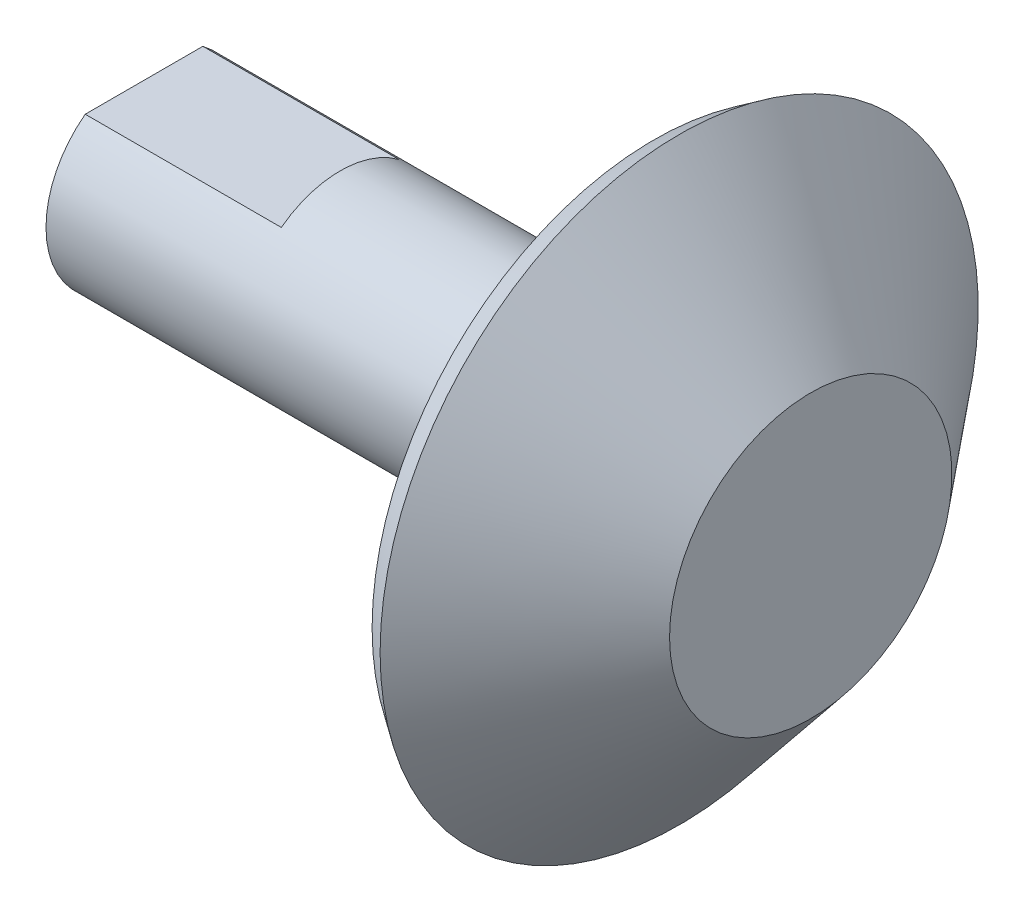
ISO-10303-21;
HEADER;
FILE_DESCRIPTION(('STEP AP214'),'2;1');
FILE_NAME('part.step','',(''),(''),'','','');
FILE_SCHEMA(('AUTOMOTIVE_DESIGN { 1 0 10303 214 1 1 1 1 }'));
ENDSEC;
DATA;
#1=APPLICATION_CONTEXT('core data for automotive mechanical design processes');
#2=APPLICATION_PROTOCOL_DEFINITION('international standard','automotive_design',2000,#1);
#3=PRODUCT_CONTEXT('',#1,'mechanical');
#4=PRODUCT('Part','Part','',(#3));
#5=PRODUCT_RELATED_PRODUCT_CATEGORY('part','',(#4));
#6=PRODUCT_DEFINITION_FORMATION('','',#4);
#7=PRODUCT_DEFINITION_CONTEXT('part definition',#1,'design');
#8=PRODUCT_DEFINITION('design','',#6,#7);
#9=PRODUCT_DEFINITION_SHAPE('','',#8);
#10=(LENGTH_UNIT() NAMED_UNIT(*) SI_UNIT(.MILLI.,.METRE.));
#11=(NAMED_UNIT(*) PLANE_ANGLE_UNIT() SI_UNIT($,.RADIAN.));
#12=(NAMED_UNIT(*) SI_UNIT($,.STERADIAN.) SOLID_ANGLE_UNIT());
#13=UNCERTAINTY_MEASURE_WITH_UNIT(LENGTH_MEASURE(1.E-05),#10,'distance_accuracy_value','');
#14=(GEOMETRIC_REPRESENTATION_CONTEXT(3) GLOBAL_UNCERTAINTY_ASSIGNED_CONTEXT((#13)) GLOBAL_UNIT_ASSIGNED_CONTEXT((#10,
#11,#12)) REPRESENTATION_CONTEXT('',''));
#15=CARTESIAN_POINT('',(0.,0.,0.));
#16=DIRECTION('',(0.,0.,1.));
#17=DIRECTION('',(1.,0.,0.));
#18=AXIS2_PLACEMENT_3D('',#15,#16,#17);
#19=CARTESIAN_POINT('',(-20.,0.,0.));
#20=DIRECTION('',(1.,0.,0.));
#21=DIRECTION('',(0.,0.,-1.));
#22=AXIS2_PLACEMENT_3D('',#19,#20,#21);
#23=PLANE('',#22);
#24=CARTESIAN_POINT('',(-20.,0.,0.));
#25=DIRECTION('',(-1.,0.,0.));
#26=DIRECTION('',(0.,0.,1.));
#27=AXIS2_PLACEMENT_3D('',#24,#25,#26);
#28=CIRCLE('',#27,2.50000000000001);
#29=CARTESIAN_POINT('',(-20.,2.,-1.50000000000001));
#30=VERTEX_POINT('',#29);
#31=CARTESIAN_POINT('',(-20.,2.,1.50000000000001));
#32=VERTEX_POINT('',#31);
#33=EDGE_CURVE('E382',#30,#32,#28,.T.);
#34=ORIENTED_EDGE('',*,*,#33,.T.);
#35=DIRECTION('',(0.,0.,1.));
#36=VECTOR('',#35,1.);
#37=CARTESIAN_POINT('',(-20.,2.,-3.29091748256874));
#38=LINE('',#37,#36);
#39=EDGE_CURVE('E377',#30,#32,#38,.T.);
#40=ORIENTED_EDGE('',*,*,#39,.F.);
#41=EDGE_LOOP('',(#34,#40));
#42=FACE_BOUND('',#41,.T.);
#43=ADVANCED_FACE('F350',(#42),#23,.F.);
#44=CARTESIAN_POINT('',(-8.66911579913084,0.,0.));
#45=DIRECTION('',(-1.,0.,0.));
#46=DIRECTION('',(0.,0.,1.));
#47=AXIS2_PLACEMENT_3D('',#44,#45,#46);
#48=CYLINDRICAL_SURFACE('',#47,2.50000000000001);
#49=CARTESIAN_POINT('',(-15.,0.,0.));
#50=DIRECTION('',(-1.,0.,0.));
#51=DIRECTION('',(0.,0.,1.));
#52=AXIS2_PLACEMENT_3D('',#49,#50,#51);
#53=CIRCLE('',#52,2.50000000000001);
#54=CARTESIAN_POINT('',(-15.,2.,1.50000000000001));
#55=VERTEX_POINT('',#54);
#56=CARTESIAN_POINT('',(-15.,2.,-1.50000000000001));
#57=VERTEX_POINT('',#56);
#58=EDGE_CURVE('E367',#55,#57,#53,.T.);
#59=ORIENTED_EDGE('',*,*,#58,.F.);
#60=DIRECTION('',(-1.,0.,0.));
#61=VECTOR('',#60,1.);
#62=CARTESIAN_POINT('',(-8.66911579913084,2.,1.50000000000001));
#63=LINE('',#62,#61);
#64=EDGE_CURVE('E11',#55,#32,#63,.T.);
#65=ORIENTED_EDGE('',*,*,#64,.T.);
#66=ORIENTED_EDGE('',*,*,#33,.F.);
#67=DIRECTION('',(-1.,0.,0.));
#68=VECTOR('',#67,1.);
#69=CARTESIAN_POINT('',(-8.66911579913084,2.,-1.50000000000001));
#70=LINE('',#69,#68);
#71=EDGE_CURVE('E357',#30,#57,#70,.F.);
#72=ORIENTED_EDGE('',*,*,#71,.T.);
#73=EDGE_LOOP('',(#59,#65,#66,#72));
#74=FACE_BOUND('',#73,.T.);
#75=CARTESIAN_POINT('',(-7.,0.,0.));
#76=DIRECTION('',(-1.,0.,0.));
#77=DIRECTION('',(0.,0.,1.));
#78=AXIS2_PLACEMENT_3D('',#75,#76,#77);
#79=CIRCLE('',#78,2.50000000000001);
#80=CARTESIAN_POINT('',(-7.,0.,2.50000000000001));
#81=VERTEX_POINT('',#80);
#82=EDGE_CURVE('E386',#81,#81,#79,.T.);
#83=ORIENTED_EDGE('',*,*,#82,.T.);
#84=EDGE_LOOP('',(#83));
#85=FACE_BOUND('',#84,.T.);
#86=ADVANCED_FACE('F384',(#74,#85),#48,.T.);
#87=CARTESIAN_POINT('',(-7.,2.50000000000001,0.));
#88=DIRECTION('',(1.,0.,0.));
#89=DIRECTION('',(0.,0.,-1.));
#90=AXIS2_PLACEMENT_3D('',#87,#88,#89);
#91=PLANE('',#90);
#92=ORIENTED_EDGE('',*,*,#82,.F.);
#93=EDGE_LOOP('',(#92));
#94=FACE_BOUND('',#93,.T.);
#95=CARTESIAN_POINT('',(-7.,0.,0.));
#96=DIRECTION('',(-1.,0.,0.));
#97=DIRECTION('',(0.,0.,1.));
#98=AXIS2_PLACEMENT_3D('',#95,#96,#97);
#99=CIRCLE('',#98,7.18468354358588);
#100=CARTESIAN_POINT('',(-7.,0.,7.18468354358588));
#101=VERTEX_POINT('',#100);
#102=EDGE_CURVE('E390',#101,#101,#99,.T.);
#103=ORIENTED_EDGE('',*,*,#102,.T.);
#104=EDGE_LOOP('',(#103));
#105=FACE_BOUND('',#104,.T.);
#106=ADVANCED_FACE('F421',(#94,#105),#91,.F.);
#107=CARTESIAN_POINT('',(-6.35498481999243,0.,0.));
#108=DIRECTION('',(1.,0.,0.));
#109=DIRECTION('',(0.,0.,-1.));
#110=AXIS2_PLACEMENT_3D('',#107,#108,#109);
#111=CONICAL_SURFACE('',#110,7.62598178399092,0.600020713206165);
#112=ORIENTED_EDGE('',*,*,#102,.F.);
#113=EDGE_LOOP('',(#112));
#114=FACE_BOUND('',#113,.T.);
#115=CARTESIAN_POINT('',(-6.35498481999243,0.,0.));
#116=DIRECTION('',(-1.,0.,0.));
#117=DIRECTION('',(0.,0.,1.));
#118=AXIS2_PLACEMENT_3D('',#115,#116,#117);
#119=CIRCLE('',#118,7.62598178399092);
#120=CARTESIAN_POINT('',(-6.35498481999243,0.,7.62598178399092));
#121=VERTEX_POINT('',#120);
#122=EDGE_CURVE('E395',#121,#121,#119,.T.);
#123=ORIENTED_EDGE('',*,*,#122,.T.);
#124=EDGE_LOOP('',(#123));
#125=FACE_BOUND('',#124,.T.);
#126=ADVANCED_FACE('F414',(#114,#125),#111,.T.);
#127=CARTESIAN_POINT('',(-3.,0.,0.));
#128=DIRECTION('',(-1.,0.,0.));
#129=DIRECTION('',(0.,0.,1.));
#130=AXIS2_PLACEMENT_3D('',#127,#128,#129);
#131=CONICAL_SURFACE('',#130,3.60000000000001,0.876058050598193);
#132=ORIENTED_EDGE('',*,*,#122,.F.);
#133=EDGE_LOOP('',(#132));
#134=FACE_BOUND('',#133,.T.);
#135=CARTESIAN_POINT('',(-3.,0.,0.));
#136=DIRECTION('',(-1.,0.,0.));
#137=DIRECTION('',(0.,0.,1.));
#138=AXIS2_PLACEMENT_3D('',#135,#136,#137);
#139=CIRCLE('',#138,3.60000000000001);
#140=CARTESIAN_POINT('',(-3.,0.,3.60000000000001));
#141=VERTEX_POINT('',#140);
#142=EDGE_CURVE('E398',#141,#141,#139,.T.);
#143=ORIENTED_EDGE('',*,*,#142,.T.);
#144=EDGE_LOOP('',(#143));
#145=FACE_BOUND('',#144,.T.);
#146=ADVANCED_FACE('F403',(#134,#145),#131,.T.);
#147=CARTESIAN_POINT('',(-3.,0.,0.));
#148=DIRECTION('',(-1.,0.,0.));
#149=DIRECTION('',(0.,0.,1.));
#150=AXIS2_PLACEMENT_3D('',#147,#148,#149);
#151=PLANE('',#150);
#152=ORIENTED_EDGE('',*,*,#142,.F.);
#153=EDGE_LOOP('',(#152));
#154=FACE_BOUND('',#153,.T.);
#155=ADVANCED_FACE('F405',(#154),#151,.F.);
#156=CARTESIAN_POINT('',(-15.,2.,-3.29091748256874));
#157=DIRECTION('',(0.,-1.,0.));
#158=DIRECTION('',(0.,0.,-1.));
#159=AXIS2_PLACEMENT_3D('',#156,#157,#158);
#160=PLANE('',#159);
#161=DIRECTION('',(0.,0.,1.));
#162=VECTOR('',#161,1.);
#163=CARTESIAN_POINT('',(-15.,2.,-3.29091748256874));
#164=LINE('',#163,#162);
#165=EDGE_CURVE('E363',#57,#55,#164,.T.);
#166=ORIENTED_EDGE('',*,*,#165,.F.);
#167=ORIENTED_EDGE('',*,*,#71,.F.);
#168=ORIENTED_EDGE('',*,*,#39,.T.);
#169=ORIENTED_EDGE('',*,*,#64,.F.);
#170=EDGE_LOOP('',(#166,#167,#168,#169));
#171=FACE_BOUND('',#170,.T.);
#172=ADVANCED_FACE('F376',(#171),#160,.F.);
#173=CARTESIAN_POINT('',(-15.,2.,-3.29091748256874));
#174=DIRECTION('',(-1.,0.,0.));
#175=DIRECTION('',(0.,0.,1.));
#176=AXIS2_PLACEMENT_3D('',#173,#174,#175);
#177=PLANE('',#176);
#178=ORIENTED_EDGE('',*,*,#58,.T.);
#179=ORIENTED_EDGE('',*,*,#165,.T.);
#180=EDGE_LOOP('',(#178,#179));
#181=FACE_BOUND('',#180,.T.);
#182=ADVANCED_FACE('F412',(#181),#177,.T.);
#183=CLOSED_SHELL('',(#43,#86,#106,#126,#146,#155,#172,#182));
#184=MANIFOLD_SOLID_BREP('B2',#183);
#185=ADVANCED_BREP_SHAPE_REPRESENTATION('',(#18,#184),#14);
#186=SHAPE_DEFINITION_REPRESENTATION(#9,#185);
ENDSEC;
END-ISO-10303-21;
